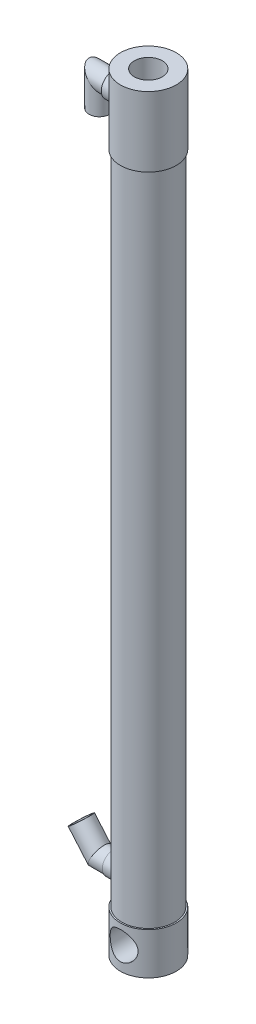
from build123d import *

# Parameters (mm, degrees)
ESQUISSE2_R                  = 20
EXTRUSION1_DEPTH             = 30
ENL_V_MAT_EXTRU_2_DEPTH      = 50
ENL_V_MAT_EXTRU_2_DEPTH_BACK = 50
ESQUISSE4_R                  = 10
ESQUISSE5_R                  = 20
ESQUISSE5_R_2                = 10
EXTRUSION2_DEPTH             = 50
ESQUISSE6_R                  = 7.5
ESQUISSE6_R_2                = 6.5
ESQUISSE8_R                  = 8.686335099
EXTRUSION3_DEPTH             = 25
ESQUISSE9_R                  = 7.5
ESQUISSE9_R_2                = 6.5
ESQUISSE11_R                 = 8
EXTRUSION4_DEPTH             = 25


with BuildPart() as part:
    # Esquisse1 → R_volution2 (revolve)
    with BuildSketch(Plane.XY, mode=Mode.PRIVATE) as r_volution2_sk:
        Polygon((0, 0), (-19, 0), (-19, 520), (-10, 520), (-10, 517), (-16, 517), (-16, 3), (0, 3), align=None)
    revolve(r_volution2_sk.sketch.rotate(Axis((0, 0, 0), (0, 1, 0)), 270), axis=Axis((0, 0, 0), (0, 1, 0)))

    # Esquisse2 → Extrusion1 (add)
    with BuildSketch(Plane.XZ):
        with Locations(Location((0, 0, 0), (0, 0, 270))):
            Circle(ESQUISSE2_R)
    extrude(amount=EXTRUSION1_DEPTH)

    # Esquisse4 → Enl_v. mat.-Extru.2 (cut, two sides: drawn at the far end of the back side and taken through both)
    with BuildSketch(Plane.XY.offset(-ENL_V_MAT_EXTRU_2_DEPTH_BACK)):
        with Locations(Location((0, -14, 0), (0, 0, 270))):
            Circle(ESQUISSE4_R)
    extrude(amount=ENL_V_MAT_EXTRU_2_DEPTH + ENL_V_MAT_EXTRU_2_DEPTH_BACK, mode=Mode.SUBTRACT)

    # Esquisse5 → Extrusion2 (add)
    with BuildSketch(Plane(origin=(0, 520, 0), x_dir=(-1, 0, 0), z_dir=(0, 1, 0))):
        with Locations(Location((0, 0, 0), (0, 0, 270))):
            Circle(ESQUISSE5_R)
        with Locations(Location((0, 0, 0), (0, 0, 270))):
            Circle(ESQUISSE5_R_2, mode=Mode.SUBTRACT)
    extrude(amount=-EXTRUSION2_DEPTH)

    # Balayage1: sweep along a path in Esquisse7
    with BuildLine(Plane.XY) as balayage1_path:
        Line((0, 498), (-35, 498))
        Line((-35, 498), (-35, 478))
    # Esquisse6 → Balayage1 (sweep)
    with BuildSketch(Plane(origin=(0, 0, 0), x_dir=(0, 0, -1), z_dir=(1, 0, 0))):
        with Locations((0, 498)):
            Circle(ESQUISSE6_R)
        with Locations((0, 498)):
            Circle(ESQUISSE6_R_2, mode=Mode.SUBTRACT)
    sweep(path=balayage1_path.line, transition=Transition.RIGHT)

    # Esquisse8 → Extrusion3 (add)
    with BuildSketch(Plane(origin=(0, 0, 0), x_dir=(0, 0, -1), z_dir=(1, 0, 0))):
        with Locations((0, 498)):
            Circle(ESQUISSE8_R)
    extrude(amount=-EXTRUSION3_DEPTH)

    # Balayage2: sweep along a path in Esquisse10
    with BuildLine(Plane.XY) as balayage2_path:
        Line((0, 15), (-35, 15))
        Line((-35, 15), (-47.999999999, 30.198684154))
    # Esquisse9 → Balayage2 (sweep)
    with BuildSketch(Plane(origin=(0, 0, 0), x_dir=(0, 0, -1), z_dir=(1, 0, 0))):
        with Locations((0, 15)):
            Circle(ESQUISSE9_R)
        with Locations((0, 15)):
            Circle(ESQUISSE9_R_2, mode=Mode.SUBTRACT)
    sweep(path=balayage2_path.line, transition=Transition.RIGHT)

    # Esquisse11 → Extrusion4 (add)
    with BuildSketch(Plane(origin=(0, 0, 0), x_dir=(0, 0, -1), z_dir=(1, 0, 0))):
        with Locations((0, 15)):
            Circle(ESQUISSE11_R)
    extrude(amount=-EXTRUSION4_DEPTH)


solid = part.part
